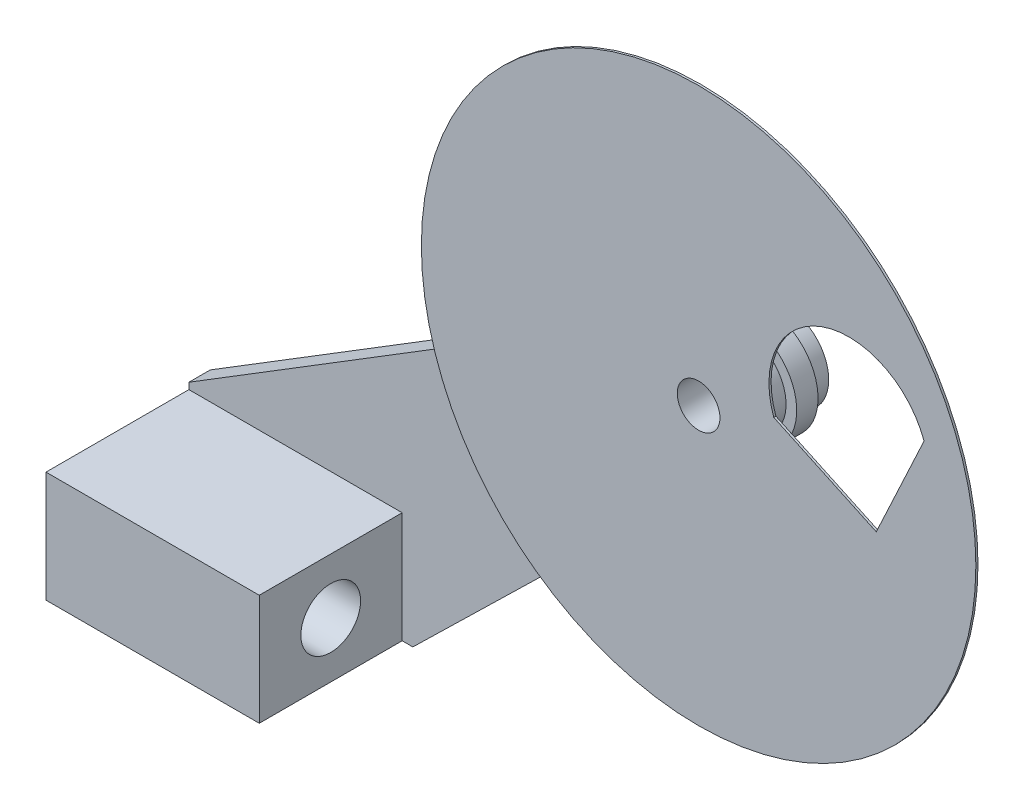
ISO-10303-21;
HEADER;
FILE_DESCRIPTION(('STEP AP214'),'2;1');
FILE_NAME('part.step','',(''),(''),'','','');
FILE_SCHEMA(('AUTOMOTIVE_DESIGN { 1 0 10303 214 1 1 1 1 }'));
ENDSEC;
DATA;
#1=APPLICATION_CONTEXT('core data for automotive mechanical design processes');
#2=APPLICATION_PROTOCOL_DEFINITION('international standard','automotive_design',2000,#1);
#3=PRODUCT_CONTEXT('',#1,'mechanical');
#4=PRODUCT('Part','Part','',(#3));
#5=PRODUCT_RELATED_PRODUCT_CATEGORY('part','',(#4));
#6=PRODUCT_DEFINITION_FORMATION('','',#4);
#7=PRODUCT_DEFINITION_CONTEXT('part definition',#1,'design');
#8=PRODUCT_DEFINITION('design','',#6,#7);
#9=PRODUCT_DEFINITION_SHAPE('','',#8);
#10=(LENGTH_UNIT() NAMED_UNIT(*) SI_UNIT(.MILLI.,.METRE.));
#11=(NAMED_UNIT(*) PLANE_ANGLE_UNIT() SI_UNIT($,.RADIAN.));
#12=(NAMED_UNIT(*) SI_UNIT($,.STERADIAN.) SOLID_ANGLE_UNIT());
#13=UNCERTAINTY_MEASURE_WITH_UNIT(LENGTH_MEASURE(1.E-05),#10,'distance_accuracy_value','');
#14=(GEOMETRIC_REPRESENTATION_CONTEXT(3) GLOBAL_UNCERTAINTY_ASSIGNED_CONTEXT((#13)) GLOBAL_UNIT_ASSIGNED_CONTEXT((#10,
#11,#12)) REPRESENTATION_CONTEXT('',''));
#15=CARTESIAN_POINT('',(0.,0.,0.));
#16=DIRECTION('',(0.,0.,1.));
#17=DIRECTION('',(1.,0.,0.));
#18=AXIS2_PLACEMENT_3D('',#15,#16,#17);
#19=CARTESIAN_POINT('',(-109.,-148.,10.));
#20=DIRECTION('',(0.,0.,-1.));
#21=DIRECTION('',(-1.,0.,0.));
#22=AXIS2_PLACEMENT_3D('',#19,#20,#21);
#23=PLANE('',#22);
#24=DIRECTION('',(1.,0.,0.));
#25=VECTOR('',#24,1.);
#26=CARTESIAN_POINT('',(-109.,-148.,10.));
#27=LINE('',#26,#25);
#28=CARTESIAN_POINT('',(-9.00000000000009,-148.,10.));
#29=VERTEX_POINT('',#28);
#30=CARTESIAN_POINT('',(-3.99999999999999,-148.,10.));
#31=VERTEX_POINT('',#30);
#32=EDGE_CURVE('E208',#29,#31,#27,.T.);
#33=ORIENTED_EDGE('',*,*,#32,.T.);
#34=DIRECTION('',(-0.716085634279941,-0.698012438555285,0.));
#35=VECTOR('',#34,1.);
#36=CARTESIAN_POINT('',(-4.,-148.,10.));
#37=LINE('',#36,#35);
#38=CARTESIAN_POINT('',(168.450310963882,20.0978591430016,10.));
#39=VERTEX_POINT('',#38);
#40=EDGE_CURVE('E155',#39,#31,#37,.T.);
#41=ORIENTED_EDGE('',*,*,#40,.F.);
#42=CARTESIAN_POINT('',(151.,38.0000000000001,10.));
#43=DIRECTION('',(0.,0.,-1.));
#44=DIRECTION('',(1.,0.,0.));
#45=AXIS2_PLACEMENT_3D('',#42,#43,#44);
#46=CIRCLE('',#45,25.);
#47=CARTESIAN_POINT('',(137.875411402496,59.2778094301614,10.));
#48=VERTEX_POINT('',#47);
#49=EDGE_CURVE('E152',#48,#39,#46,.T.);
#50=ORIENTED_EDGE('',*,*,#49,.F.);
#51=DIRECTION('',(0.85111237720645,0.524983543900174,0.));
#52=VECTOR('',#51,1.);
#53=CARTESIAN_POINT('',(-109.,-93.0000000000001,10.));
#54=LINE('',#53,#52);
#55=CARTESIAN_POINT('',(-109.,-93.0000000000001,10.));
#56=VERTEX_POINT('',#55);
#57=EDGE_CURVE('E149',#56,#48,#54,.T.);
#58=ORIENTED_EDGE('',*,*,#57,.F.);
#59=DIRECTION('',(0.,-1.,0.));
#60=VECTOR('',#59,1.);
#61=CARTESIAN_POINT('',(-109.,-148.,10.));
#62=LINE('',#61,#60);
#63=CARTESIAN_POINT('',(-109.,-95.9999999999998,10.));
#64=VERTEX_POINT('',#63);
#65=EDGE_CURVE('E206',#56,#64,#62,.T.);
#66=ORIENTED_EDGE('',*,*,#65,.T.);
#67=DIRECTION('',(-1.,0.,0.));
#68=VECTOR('',#67,1.);
#69=CARTESIAN_POINT('',(-109.,-95.9999999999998,10.));
#70=LINE('',#69,#68);
#71=CARTESIAN_POINT('',(-9.00000000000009,-95.9999999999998,10.));
#72=VERTEX_POINT('',#71);
#73=EDGE_CURVE('E192',#72,#64,#70,.T.);
#74=ORIENTED_EDGE('',*,*,#73,.F.);
#75=DIRECTION('',(0.,1.,0.));
#76=VECTOR('',#75,1.);
#77=CARTESIAN_POINT('',(-9.00000000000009,-148.,10.));
#78=LINE('',#77,#76);
#79=EDGE_CURVE('E186',#29,#72,#78,.T.);
#80=ORIENTED_EDGE('',*,*,#79,.F.);
#81=EDGE_LOOP('',(#33,#41,#50,#58,#66,#74,#80));
#82=FACE_BOUND('',#81,.T.);
#83=CARTESIAN_POINT('',(151.,38.0000000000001,10.));
#84=DIRECTION('',(0.,0.,-1.));
#85=DIRECTION('',(-1.,0.,0.));
#86=AXIS2_PLACEMENT_3D('',#83,#84,#85);
#87=CIRCLE('',#86,20.);
#88=CARTESIAN_POINT('',(131.,38.0000000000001,10.));
#89=VERTEX_POINT('',#88);
#90=EDGE_CURVE('E36',#89,#89,#87,.F.);
#91=ORIENTED_EDGE('',*,*,#90,.F.);
#92=EDGE_LOOP('',(#91));
#93=FACE_BOUND('',#92,.T.);
#94=ADVANCED_FACE('F28',(#82,#93),#23,.F.);
#95=CARTESIAN_POINT('',(-109.,-148.,0.));
#96=DIRECTION('',(0.,0.,-1.));
#97=DIRECTION('',(-1.,0.,0.));
#98=AXIS2_PLACEMENT_3D('',#95,#96,#97);
#99=PLANE('',#98);
#100=DIRECTION('',(0.716085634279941,0.698012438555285,0.));
#101=VECTOR('',#100,1.);
#102=CARTESIAN_POINT('',(-57.8417567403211,-200.482851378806,0.));
#103=LINE('',#102,#101);
#104=CARTESIAN_POINT('',(-4.,-148.,0.));
#105=VERTEX_POINT('',#104);
#106=CARTESIAN_POINT('',(168.450310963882,20.0978591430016,0.));
#107=VERTEX_POINT('',#106);
#108=EDGE_CURVE('E161',#105,#107,#103,.T.);
#109=ORIENTED_EDGE('',*,*,#108,.F.);
#110=DIRECTION('',(1.,0.,0.));
#111=VECTOR('',#110,1.);
#112=CARTESIAN_POINT('',(-109.,-148.,0.));
#113=LINE('',#112,#111);
#114=CARTESIAN_POINT('',(-109.,-148.,0.));
#115=VERTEX_POINT('',#114);
#116=EDGE_CURVE('E209',#115,#105,#113,.T.);
#117=ORIENTED_EDGE('',*,*,#116,.F.);
#118=DIRECTION('',(0.,-1.,0.));
#119=VECTOR('',#118,1.);
#120=CARTESIAN_POINT('',(-109.,-148.,0.));
#121=LINE('',#120,#119);
#122=CARTESIAN_POINT('',(-109.,-93.0000000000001,0.));
#123=VERTEX_POINT('',#122);
#124=EDGE_CURVE('E224',#123,#115,#121,.T.);
#125=ORIENTED_EDGE('',*,*,#124,.F.);
#126=DIRECTION('',(-0.85111237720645,-0.524983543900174,0.));
#127=VECTOR('',#126,1.);
#128=CARTESIAN_POINT('',(-133.575099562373,-108.158424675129,0.));
#129=LINE('',#128,#127);
#130=CARTESIAN_POINT('',(137.875411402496,59.2778094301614,0.));
#131=VERTEX_POINT('',#130);
#132=EDGE_CURVE('E168',#131,#123,#129,.T.);
#133=ORIENTED_EDGE('',*,*,#132,.F.);
#134=CARTESIAN_POINT('',(151.,38.0000000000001,0.));
#135=DIRECTION('',(0.,0.,-1.));
#136=DIRECTION('',(-1.,0.,0.));
#137=AXIS2_PLACEMENT_3D('',#134,#135,#136);
#138=CIRCLE('',#137,25.);
#139=EDGE_CURVE('E11',#107,#131,#138,.F.);
#140=ORIENTED_EDGE('',*,*,#139,.F.);
#141=EDGE_LOOP('',(#109,#117,#125,#133,#140));
#142=FACE_BOUND('',#141,.T.);
#143=CARTESIAN_POINT('',(151.,38.0000000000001,0.));
#144=DIRECTION('',(0.,0.,-1.));
#145=DIRECTION('',(-1.,0.,0.));
#146=AXIS2_PLACEMENT_3D('',#143,#144,#145);
#147=CIRCLE('',#146,20.);
#148=CARTESIAN_POINT('',(131.,38.0000000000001,0.));
#149=VERTEX_POINT('',#148);
#150=EDGE_CURVE('E176',#149,#149,#147,.F.);
#151=ORIENTED_EDGE('',*,*,#150,.T.);
#152=EDGE_LOOP('',(#151));
#153=FACE_BOUND('',#152,.T.);
#154=ADVANCED_FACE('F263',(#142,#153),#99,.T.);
#155=CARTESIAN_POINT('',(-109.,-148.,10.));
#156=DIRECTION('',(1.,0.,0.));
#157=DIRECTION('',(0.,1.,0.));
#158=AXIS2_PLACEMENT_3D('',#155,#156,#157);
#159=PLANE('',#158);
#160=CARTESIAN_POINT('',(-109.,-122.,43.5));
#161=DIRECTION('',(1.,0.,0.));
#162=DIRECTION('',(0.,1.,0.));
#163=AXIS2_PLACEMENT_3D('',#160,#161,#162);
#164=CIRCLE('',#163,14.);
#165=CARTESIAN_POINT('',(-109.,-108.,43.5));
#166=VERTEX_POINT('',#165);
#167=EDGE_CURVE('E183',#166,#166,#164,.T.);
#168=ORIENTED_EDGE('',*,*,#167,.T.);
#169=EDGE_LOOP('',(#168));
#170=FACE_BOUND('',#169,.T.);
#171=ORIENTED_EDGE('',*,*,#65,.F.);
#172=DIRECTION('',(0.,0.,1.));
#173=VECTOR('',#172,1.);
#174=CARTESIAN_POINT('',(-109.,-93.0000000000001,-9.99999999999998));
#175=LINE('',#174,#173);
#176=EDGE_CURVE('E157',#123,#56,#175,.T.);
#177=ORIENTED_EDGE('',*,*,#176,.F.);
#178=ORIENTED_EDGE('',*,*,#124,.T.);
#179=DIRECTION('',(0.,0.,-1.));
#180=VECTOR('',#179,1.);
#181=CARTESIAN_POINT('',(-109.,-148.,10.));
#182=LINE('',#181,#180);
#183=CARTESIAN_POINT('',(-109.,-148.,77.));
#184=VERTEX_POINT('',#183);
#185=EDGE_CURVE('E179',#184,#115,#182,.T.);
#186=ORIENTED_EDGE('',*,*,#185,.F.);
#187=DIRECTION('',(0.,-1.,0.));
#188=VECTOR('',#187,1.);
#189=CARTESIAN_POINT('',(-109.,-148.,77.));
#190=LINE('',#189,#188);
#191=CARTESIAN_POINT('',(-109.,-95.9999999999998,77.));
#192=VERTEX_POINT('',#191);
#193=EDGE_CURVE('E189',#192,#184,#190,.T.);
#194=ORIENTED_EDGE('',*,*,#193,.F.);
#195=DIRECTION('',(0.,0.,-1.));
#196=VECTOR('',#195,1.);
#197=CARTESIAN_POINT('',(-109.,-95.9999999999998,77.));
#198=LINE('',#197,#196);
#199=EDGE_CURVE('E198',#192,#64,#198,.T.);
#200=ORIENTED_EDGE('',*,*,#199,.T.);
#201=EDGE_LOOP('',(#171,#177,#178,#186,#194,#200));
#202=FACE_BOUND('',#201,.T.);
#203=ADVANCED_FACE('F30',(#170,#202),#159,.F.);
#204=CARTESIAN_POINT('',(-109.,-148.,10.));
#205=DIRECTION('',(0.,1.,0.));
#206=DIRECTION('',(0.,0.,1.));
#207=AXIS2_PLACEMENT_3D('',#204,#205,#206);
#208=PLANE('',#207);
#209=ORIENTED_EDGE('',*,*,#116,.T.);
#210=DIRECTION('',(0.,0.,1.));
#211=VECTOR('',#210,1.);
#212=CARTESIAN_POINT('',(-4.,-148.,-9.99999999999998));
#213=LINE('',#212,#211);
#214=EDGE_CURVE('E158',#105,#31,#213,.T.);
#215=ORIENTED_EDGE('',*,*,#214,.T.);
#216=ORIENTED_EDGE('',*,*,#32,.F.);
#217=DIRECTION('',(0.,0.,-1.));
#218=VECTOR('',#217,1.);
#219=CARTESIAN_POINT('',(-9.00000000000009,-148.,77.));
#220=LINE('',#219,#218);
#221=CARTESIAN_POINT('',(-9.00000000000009,-148.,77.));
#222=VERTEX_POINT('',#221);
#223=EDGE_CURVE('E222',#222,#29,#220,.T.);
#224=ORIENTED_EDGE('',*,*,#223,.F.);
#225=DIRECTION('',(1.,0.,0.));
#226=VECTOR('',#225,1.);
#227=CARTESIAN_POINT('',(-109.,-148.,77.));
#228=LINE('',#227,#226);
#229=EDGE_CURVE('E236',#184,#222,#228,.T.);
#230=ORIENTED_EDGE('',*,*,#229,.F.);
#231=ORIENTED_EDGE('',*,*,#185,.T.);
#232=EDGE_LOOP('',(#209,#215,#216,#224,#230,#231));
#233=FACE_BOUND('',#232,.T.);
#234=ADVANCED_FACE('F251',(#233),#208,.F.);
#235=CARTESIAN_POINT('',(-9.00000000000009,-148.,77.));
#236=DIRECTION('',(-1.,0.,0.));
#237=DIRECTION('',(0.,0.,1.));
#238=AXIS2_PLACEMENT_3D('',#235,#236,#237);
#239=PLANE('',#238);
#240=CARTESIAN_POINT('',(-9.00000000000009,-122.,43.5));
#241=DIRECTION('',(1.,0.,0.));
#242=DIRECTION('',(0.,0.,-1.));
#243=AXIS2_PLACEMENT_3D('',#240,#241,#242);
#244=CIRCLE('',#243,14.);
#245=CARTESIAN_POINT('',(-9.00000000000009,-122.,29.5));
#246=VERTEX_POINT('',#245);
#247=EDGE_CURVE('E180',#246,#246,#244,.T.);
#248=ORIENTED_EDGE('',*,*,#247,.F.);
#249=EDGE_LOOP('',(#248));
#250=FACE_BOUND('',#249,.T.);
#251=ORIENTED_EDGE('',*,*,#79,.T.);
#252=DIRECTION('',(0.,0.,-1.));
#253=VECTOR('',#252,1.);
#254=CARTESIAN_POINT('',(-9.00000000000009,-95.9999999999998,77.));
#255=LINE('',#254,#253);
#256=CARTESIAN_POINT('',(-9.00000000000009,-95.9999999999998,77.));
#257=VERTEX_POINT('',#256);
#258=EDGE_CURVE('E201',#257,#72,#255,.T.);
#259=ORIENTED_EDGE('',*,*,#258,.F.);
#260=DIRECTION('',(0.,1.,0.));
#261=VECTOR('',#260,1.);
#262=CARTESIAN_POINT('',(-9.00000000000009,-148.,77.));
#263=LINE('',#262,#261);
#264=EDGE_CURVE('E235',#222,#257,#263,.T.);
#265=ORIENTED_EDGE('',*,*,#264,.F.);
#266=ORIENTED_EDGE('',*,*,#223,.T.);
#267=EDGE_LOOP('',(#251,#259,#265,#266));
#268=FACE_BOUND('',#267,.T.);
#269=ADVANCED_FACE('F253',(#250,#268),#239,.F.);
#270=CARTESIAN_POINT('',(-109.,-95.9999999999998,77.));
#271=DIRECTION('',(0.,-1.,0.));
#272=DIRECTION('',(0.,0.,-1.));
#273=AXIS2_PLACEMENT_3D('',#270,#271,#272);
#274=PLANE('',#273);
#275=ORIENTED_EDGE('',*,*,#73,.T.);
#276=ORIENTED_EDGE('',*,*,#199,.F.);
#277=DIRECTION('',(-1.,0.,0.));
#278=VECTOR('',#277,1.);
#279=CARTESIAN_POINT('',(-109.,-95.9999999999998,77.));
#280=LINE('',#279,#278);
#281=EDGE_CURVE('E202',#257,#192,#280,.T.);
#282=ORIENTED_EDGE('',*,*,#281,.F.);
#283=ORIENTED_EDGE('',*,*,#258,.T.);
#284=EDGE_LOOP('',(#275,#276,#282,#283));
#285=FACE_BOUND('',#284,.T.);
#286=ADVANCED_FACE('F254',(#285),#274,.F.);
#287=CARTESIAN_POINT('',(-109.,-95.9999999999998,77.));
#288=DIRECTION('',(0.,0.,-1.));
#289=DIRECTION('',(-1.,0.,0.));
#290=AXIS2_PLACEMENT_3D('',#287,#288,#289);
#291=PLANE('',#290);
#292=ORIENTED_EDGE('',*,*,#193,.T.);
#293=ORIENTED_EDGE('',*,*,#229,.T.);
#294=ORIENTED_EDGE('',*,*,#264,.T.);
#295=ORIENTED_EDGE('',*,*,#281,.T.);
#296=EDGE_LOOP('',(#292,#293,#294,#295));
#297=FACE_BOUND('',#296,.T.);
#298=ADVANCED_FACE('F241',(#297),#291,.F.);
#299=CARTESIAN_POINT('',(-109.00005,-122.,43.5));
#300=DIRECTION('',(1.,0.,0.));
#301=DIRECTION('',(0.,0.,-1.));
#302=AXIS2_PLACEMENT_3D('',#299,#300,#301);
#303=CYLINDRICAL_SURFACE('',#302,14.);
#304=ORIENTED_EDGE('',*,*,#247,.T.);
#305=EDGE_LOOP('',(#304));
#306=FACE_BOUND('',#305,.T.);
#307=ORIENTED_EDGE('',*,*,#167,.F.);
#308=EDGE_LOOP('',(#307));
#309=FACE_BOUND('',#308,.T.);
#310=ADVANCED_FACE('F305',(#306,#309),#303,.F.);
#311=CARTESIAN_POINT('',(151.,38.0000000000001,-9.99999999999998));
#312=DIRECTION('',(0.,0.,1.));
#313=DIRECTION('',(1.,0.,0.));
#314=AXIS2_PLACEMENT_3D('',#311,#312,#313);
#315=PLANE('',#314);
#316=CARTESIAN_POINT('',(151.,38.0000000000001,-9.99999999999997));
#317=DIRECTION('',(0.,0.,1.));
#318=DIRECTION('',(1.,0.,0.));
#319=AXIS2_PLACEMENT_3D('',#316,#317,#318);
#320=CIRCLE('',#319,10.);
#321=CARTESIAN_POINT('',(161.,38.0000000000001,-9.99999999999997));
#322=VERTEX_POINT('',#321);
#323=EDGE_CURVE('E140',#322,#322,#320,.T.);
#324=ORIENTED_EDGE('',*,*,#323,.T.);
#325=EDGE_LOOP('',(#324));
#326=FACE_BOUND('',#325,.T.);
#327=CARTESIAN_POINT('',(151.,38.0000000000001,-9.99999999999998));
#328=DIRECTION('',(0.,0.,1.));
#329=DIRECTION('',(1.,0.,0.));
#330=AXIS2_PLACEMENT_3D('',#327,#328,#329);
#331=CIRCLE('',#330,20.);
#332=CARTESIAN_POINT('',(171.,38.0000000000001,-9.99999999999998));
#333=VERTEX_POINT('',#332);
#334=EDGE_CURVE('E170',#333,#333,#331,.T.);
#335=ORIENTED_EDGE('',*,*,#334,.F.);
#336=EDGE_LOOP('',(#335));
#337=FACE_BOUND('',#336,.T.);
#338=ADVANCED_FACE('F307',(#326,#337),#315,.F.);
#339=CARTESIAN_POINT('',(151.,38.0000000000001,30.));
#340=DIRECTION('',(0.,0.,-1.));
#341=DIRECTION('',(-1.,0.,0.));
#342=AXIS2_PLACEMENT_3D('',#339,#340,#341);
#343=CYLINDRICAL_SURFACE('',#342,20.);
#344=ORIENTED_EDGE('',*,*,#150,.F.);
#345=EDGE_LOOP('',(#344));
#346=FACE_BOUND('',#345,.T.);
#347=ORIENTED_EDGE('',*,*,#334,.T.);
#348=EDGE_LOOP('',(#347));
#349=FACE_BOUND('',#348,.T.);
#350=ADVANCED_FACE('F314',(#346,#349),#343,.T.);
#351=CARTESIAN_POINT('',(151.,38.0000000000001,30.));
#352=DIRECTION('',(0.,0.,1.));
#353=DIRECTION('',(1.,0.,0.));
#354=AXIS2_PLACEMENT_3D('',#351,#352,#353);
#355=CIRCLE('',#354,20.);
#356=CARTESIAN_POINT('',(171.,38.0000000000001,30.));
#357=VERTEX_POINT('',#356);
#358=EDGE_CURVE('E173',#357,#357,#355,.T.);
#359=ORIENTED_EDGE('',*,*,#358,.F.);
#360=EDGE_LOOP('',(#359));
#361=FACE_BOUND('',#360,.T.);
#362=ORIENTED_EDGE('',*,*,#90,.T.);
#363=EDGE_LOOP('',(#362));
#364=FACE_BOUND('',#363,.T.);
#365=ADVANCED_FACE('F360',(#361,#364),#343,.T.);
#366=CARTESIAN_POINT('',(-4.,-148.,-9.99999999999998));
#367=DIRECTION('',(-0.698012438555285,0.716085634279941,0.));
#368=DIRECTION('',(-0.716085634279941,-0.698012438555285,0.));
#369=AXIS2_PLACEMENT_3D('',#366,#367,#368);
#370=PLANE('',#369);
#371=ORIENTED_EDGE('',*,*,#108,.T.);
#372=DIRECTION('',(0.,0.,1.));
#373=VECTOR('',#372,1.);
#374=CARTESIAN_POINT('',(168.450310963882,20.0978591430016,-9.99999999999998));
#375=LINE('',#374,#373);
#376=EDGE_CURVE('E162',#107,#39,#375,.T.);
#377=ORIENTED_EDGE('',*,*,#376,.T.);
#378=ORIENTED_EDGE('',*,*,#40,.T.);
#379=ORIENTED_EDGE('',*,*,#214,.F.);
#380=EDGE_LOOP('',(#371,#377,#378,#379));
#381=FACE_BOUND('',#380,.T.);
#382=ADVANCED_FACE('F268',(#381),#370,.F.);
#383=CARTESIAN_POINT('',(151.,38.0000000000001,-9.99999999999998));
#384=DIRECTION('',(0.,0.,1.));
#385=DIRECTION('',(1.,0.,0.));
#386=AXIS2_PLACEMENT_3D('',#383,#384,#385);
#387=CYLINDRICAL_SURFACE('',#386,25.);
#388=ORIENTED_EDGE('',*,*,#139,.T.);
#389=DIRECTION('',(0.,0.,1.));
#390=VECTOR('',#389,1.);
#391=CARTESIAN_POINT('',(137.875411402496,59.2778094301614,-9.99999999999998));
#392=LINE('',#391,#390);
#393=EDGE_CURVE('E164',#131,#48,#392,.T.);
#394=ORIENTED_EDGE('',*,*,#393,.T.);
#395=ORIENTED_EDGE('',*,*,#49,.T.);
#396=ORIENTED_EDGE('',*,*,#376,.F.);
#397=EDGE_LOOP('',(#388,#394,#395,#396));
#398=FACE_BOUND('',#397,.T.);
#399=ADVANCED_FACE('F271',(#398),#387,.T.);
#400=CARTESIAN_POINT('',(-109.,-93.0000000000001,-9.99999999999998));
#401=DIRECTION('',(0.524983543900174,-0.85111237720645,0.));
#402=DIRECTION('',(0.85111237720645,0.524983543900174,0.));
#403=AXIS2_PLACEMENT_3D('',#400,#401,#402);
#404=PLANE('',#403);
#405=ORIENTED_EDGE('',*,*,#132,.T.);
#406=ORIENTED_EDGE('',*,*,#176,.T.);
#407=ORIENTED_EDGE('',*,*,#57,.T.);
#408=ORIENTED_EDGE('',*,*,#393,.F.);
#409=EDGE_LOOP('',(#405,#406,#407,#408));
#410=FACE_BOUND('',#409,.T.);
#411=ADVANCED_FACE('F273',(#410),#404,.F.);
#412=CARTESIAN_POINT('',(151.,38.0000000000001,30.));
#413=DIRECTION('',(0.,0.,1.));
#414=DIRECTION('',(1.,0.,0.));
#415=AXIS2_PLACEMENT_3D('',#412,#413,#414);
#416=PLANE('',#415);
#417=DIRECTION('',(-0.422618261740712,-0.906307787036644,0.));
#418=VECTOR('',#417,1.);
#419=CARTESIAN_POINT('',(256.715419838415,76.477266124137,30.));
#420=LINE('',#419,#418);
#421=CARTESIAN_POINT('',(256.715419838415,76.477266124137,30.));
#422=VERTEX_POINT('',#421);
#423=CARTESIAN_POINT('',(234.302701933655,28.4130374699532,30.));
#424=VERTEX_POINT('',#423);
#425=EDGE_CURVE('E43',#422,#424,#420,.T.);
#426=ORIENTED_EDGE('',*,*,#425,.F.);
#427=CARTESIAN_POINT('',(221.476946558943,63.6515107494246,30.));
#428=DIRECTION('',(0.,0.,1.));
#429=DIRECTION('',(1.,0.,0.));
#430=AXIS2_PLACEMENT_3D('',#427,#428,#429);
#431=CIRCLE('',#430,37.5);
#432=CARTESIAN_POINT('',(186.238473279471,50.8257553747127,30.));
#433=VERTEX_POINT('',#432);
#434=EDGE_CURVE('E112',#433,#422,#431,.F.);
#435=ORIENTED_EDGE('',*,*,#434,.F.);
#436=DIRECTION('',(-0.906307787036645,0.42261826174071,0.));
#437=VECTOR('',#436,1.);
#438=CARTESIAN_POINT('',(234.302701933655,28.4130374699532,30.));
#439=LINE('',#438,#437);
#440=EDGE_CURVE('E120',#424,#433,#439,.T.);
#441=ORIENTED_EDGE('',*,*,#440,.F.);
#442=EDGE_LOOP('',(#426,#435,#441));
#443=FACE_BOUND('',#442,.T.);
#444=CARTESIAN_POINT('',(151.,38.0000000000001,30.));
#445=DIRECTION('',(0.,0.,1.));
#446=DIRECTION('',(1.,0.,0.));
#447=AXIS2_PLACEMENT_3D('',#444,#445,#446);
#448=CIRCLE('',#447,130.);
#449=CARTESIAN_POINT('',(281.,38.0000000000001,30.));
#450=VERTEX_POINT('',#449);
#451=EDGE_CURVE('E143',#450,#450,#448,.T.);
#452=ORIENTED_EDGE('',*,*,#451,.F.);
#453=EDGE_LOOP('',(#452));
#454=FACE_BOUND('',#453,.T.);
#455=ORIENTED_EDGE('',*,*,#358,.T.);
#456=EDGE_LOOP('',(#455));
#457=FACE_BOUND('',#456,.T.);
#458=ADVANCED_FACE('F126',(#443,#454,#457),#416,.F.);
#459=CARTESIAN_POINT('',(151.,38.0000000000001,31.));
#460=DIRECTION('',(0.,0.,-1.));
#461=DIRECTION('',(-1.,0.,0.));
#462=AXIS2_PLACEMENT_3D('',#459,#460,#461);
#463=CYLINDRICAL_SURFACE('',#462,130.);
#464=CARTESIAN_POINT('',(151.,38.0000000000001,31.));
#465=DIRECTION('',(0.,0.,1.));
#466=DIRECTION('',(1.,0.,0.));
#467=AXIS2_PLACEMENT_3D('',#464,#465,#466);
#468=CIRCLE('',#467,130.);
#469=CARTESIAN_POINT('',(281.,38.0000000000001,31.));
#470=VERTEX_POINT('',#469);
#471=EDGE_CURVE('E146',#470,#470,#468,.T.);
#472=ORIENTED_EDGE('',*,*,#471,.F.);
#473=EDGE_LOOP('',(#472));
#474=FACE_BOUND('',#473,.T.);
#475=ORIENTED_EDGE('',*,*,#451,.T.);
#476=EDGE_LOOP('',(#475));
#477=FACE_BOUND('',#476,.T.);
#478=ADVANCED_FACE('F281',(#474,#477),#463,.T.);
#479=CARTESIAN_POINT('',(151.,38.0000000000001,31.));
#480=DIRECTION('',(0.,0.,1.));
#481=DIRECTION('',(1.,0.,0.));
#482=AXIS2_PLACEMENT_3D('',#479,#480,#481);
#483=PLANE('',#482);
#484=CARTESIAN_POINT('',(221.476946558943,63.6515107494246,31.));
#485=DIRECTION('',(0.,0.,1.));
#486=DIRECTION('',(1.,0.,0.));
#487=AXIS2_PLACEMENT_3D('',#484,#485,#486);
#488=CIRCLE('',#487,37.5);
#489=CARTESIAN_POINT('',(256.715419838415,76.477266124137,31.));
#490=VERTEX_POINT('',#489);
#491=CARTESIAN_POINT('',(186.238473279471,50.8257553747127,31.));
#492=VERTEX_POINT('',#491);
#493=EDGE_CURVE('E51',#490,#492,#488,.T.);
#494=ORIENTED_EDGE('',*,*,#493,.F.);
#495=DIRECTION('',(0.422618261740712,0.906307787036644,0.));
#496=VECTOR('',#495,1.);
#497=CARTESIAN_POINT('',(256.715419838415,76.477266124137,31.));
#498=LINE('',#497,#496);
#499=CARTESIAN_POINT('',(234.302701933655,28.4130374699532,31.));
#500=VERTEX_POINT('',#499);
#501=EDGE_CURVE('E117',#500,#490,#498,.T.);
#502=ORIENTED_EDGE('',*,*,#501,.F.);
#503=DIRECTION('',(0.906307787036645,-0.42261826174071,0.));
#504=VECTOR('',#503,1.);
#505=CARTESIAN_POINT('',(234.302701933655,28.4130374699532,31.));
#506=LINE('',#505,#504);
#507=EDGE_CURVE('E129',#492,#500,#506,.T.);
#508=ORIENTED_EDGE('',*,*,#507,.F.);
#509=EDGE_LOOP('',(#494,#502,#508));
#510=FACE_BOUND('',#509,.T.);
#511=CARTESIAN_POINT('',(151.,38.0000000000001,31.));
#512=DIRECTION('',(0.,0.,1.));
#513=DIRECTION('',(1.,0.,0.));
#514=AXIS2_PLACEMENT_3D('',#511,#512,#513);
#515=CIRCLE('',#514,10.);
#516=CARTESIAN_POINT('',(161.,38.0000000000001,31.));
#517=VERTEX_POINT('',#516);
#518=EDGE_CURVE('E123',#517,#517,#515,.T.);
#519=ORIENTED_EDGE('',*,*,#518,.F.);
#520=EDGE_LOOP('',(#519));
#521=FACE_BOUND('',#520,.T.);
#522=ORIENTED_EDGE('',*,*,#471,.T.);
#523=EDGE_LOOP('',(#522));
#524=FACE_BOUND('',#523,.T.);
#525=ADVANCED_FACE('F387',(#510,#521,#524),#483,.T.);
#526=CARTESIAN_POINT('',(151.,38.0000000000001,-9.99999999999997));
#527=DIRECTION('',(0.,0.,1.));
#528=DIRECTION('',(1.,0.,0.));
#529=AXIS2_PLACEMENT_3D('',#526,#527,#528);
#530=CYLINDRICAL_SURFACE('',#529,10.);
#531=ORIENTED_EDGE('',*,*,#323,.F.);
#532=EDGE_LOOP('',(#531));
#533=FACE_BOUND('',#532,.T.);
#534=ORIENTED_EDGE('',*,*,#518,.T.);
#535=EDGE_LOOP('',(#534));
#536=FACE_BOUND('',#535,.T.);
#537=ADVANCED_FACE('F394',(#533,#536),#530,.F.);
#538=CARTESIAN_POINT('',(221.476946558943,63.6515107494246,-10.001));
#539=DIRECTION('',(0.,0.,1.));
#540=DIRECTION('',(1.,0.,0.));
#541=AXIS2_PLACEMENT_3D('',#538,#539,#540);
#542=CYLINDRICAL_SURFACE('',#541,37.5);
#543=ORIENTED_EDGE('',*,*,#434,.T.);
#544=DIRECTION('',(0.,0.,1.));
#545=VECTOR('',#544,1.);
#546=CARTESIAN_POINT('',(256.715419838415,76.477266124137,-10.001));
#547=LINE('',#546,#545);
#548=EDGE_CURVE('E124',#422,#490,#547,.T.);
#549=ORIENTED_EDGE('',*,*,#548,.T.);
#550=ORIENTED_EDGE('',*,*,#493,.T.);
#551=DIRECTION('',(0.,0.,1.));
#552=VECTOR('',#551,1.);
#553=CARTESIAN_POINT('',(186.238473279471,50.8257553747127,-10.001));
#554=LINE('',#553,#552);
#555=EDGE_CURVE('E108',#433,#492,#554,.T.);
#556=ORIENTED_EDGE('',*,*,#555,.F.);
#557=EDGE_LOOP('',(#543,#549,#550,#556));
#558=FACE_BOUND('',#557,.T.);
#559=ADVANCED_FACE('F110',(#558),#542,.F.);
#560=CARTESIAN_POINT('',(256.715419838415,76.477266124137,-10.001));
#561=DIRECTION('',(0.906307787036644,-0.422618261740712,0.));
#562=DIRECTION('',(0.422618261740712,0.906307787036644,0.));
#563=AXIS2_PLACEMENT_3D('',#560,#561,#562);
#564=PLANE('',#563);
#565=ORIENTED_EDGE('',*,*,#425,.T.);
#566=DIRECTION('',(0.,0.,1.));
#567=VECTOR('',#566,1.);
#568=CARTESIAN_POINT('',(234.302701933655,28.4130374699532,-10.001));
#569=LINE('',#568,#567);
#570=EDGE_CURVE('E116',#424,#500,#569,.T.);
#571=ORIENTED_EDGE('',*,*,#570,.T.);
#572=ORIENTED_EDGE('',*,*,#501,.T.);
#573=ORIENTED_EDGE('',*,*,#548,.F.);
#574=EDGE_LOOP('',(#565,#571,#572,#573));
#575=FACE_BOUND('',#574,.T.);
#576=ADVANCED_FACE('F408',(#575),#564,.F.);
#577=CARTESIAN_POINT('',(234.302701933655,28.4130374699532,-10.001));
#578=DIRECTION('',(-0.42261826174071,-0.906307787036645,0.));
#579=DIRECTION('',(0.906307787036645,-0.42261826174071,0.));
#580=AXIS2_PLACEMENT_3D('',#577,#578,#579);
#581=PLANE('',#580);
#582=ORIENTED_EDGE('',*,*,#440,.T.);
#583=ORIENTED_EDGE('',*,*,#555,.T.);
#584=ORIENTED_EDGE('',*,*,#507,.T.);
#585=ORIENTED_EDGE('',*,*,#570,.F.);
#586=EDGE_LOOP('',(#582,#583,#584,#585));
#587=FACE_BOUND('',#586,.T.);
#588=ADVANCED_FACE('F121',(#587),#581,.F.);
#589=CLOSED_SHELL('',(#94,#154,#203,#234,#269,#286,#298,#310,#338,#350,#365,#382,#399,#411,#458,
#478,#525,#537,#559,#576,#588));
#590=MANIFOLD_SOLID_BREP('B2',#589);
#591=ADVANCED_BREP_SHAPE_REPRESENTATION('',(#18,#590),#14);
#592=SHAPE_DEFINITION_REPRESENTATION(#9,#591);
ENDSEC;
END-ISO-10303-21;
